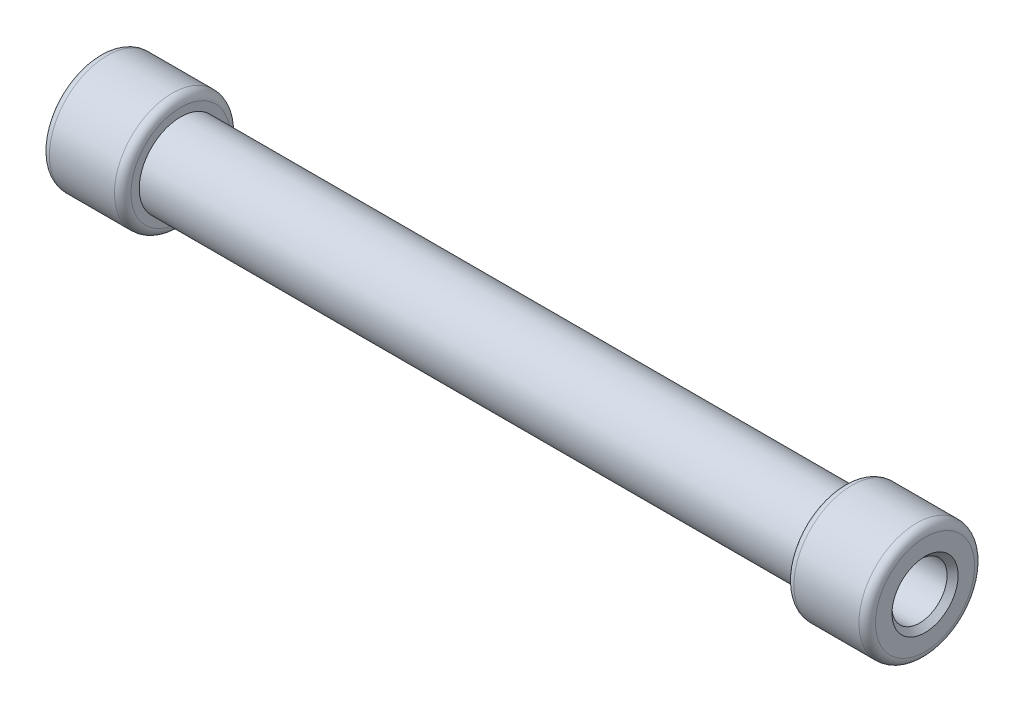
ISO-10303-21;
HEADER;
FILE_DESCRIPTION(('STEP AP214'),'2;1');
FILE_NAME('part.step','',(''),(''),'','','');
FILE_SCHEMA(('AUTOMOTIVE_DESIGN { 1 0 10303 214 1 1 1 1 }'));
ENDSEC;
DATA;
#1=APPLICATION_CONTEXT('core data for automotive mechanical design processes');
#2=APPLICATION_PROTOCOL_DEFINITION('international standard','automotive_design',2000,#1);
#3=PRODUCT_CONTEXT('',#1,'mechanical');
#4=PRODUCT('Part','Part','',(#3));
#5=PRODUCT_RELATED_PRODUCT_CATEGORY('part','',(#4));
#6=PRODUCT_DEFINITION_FORMATION('','',#4);
#7=PRODUCT_DEFINITION_CONTEXT('part definition',#1,'design');
#8=PRODUCT_DEFINITION('design','',#6,#7);
#9=PRODUCT_DEFINITION_SHAPE('','',#8);
#10=(LENGTH_UNIT() NAMED_UNIT(*) SI_UNIT(.MILLI.,.METRE.));
#11=(NAMED_UNIT(*) PLANE_ANGLE_UNIT() SI_UNIT($,.RADIAN.));
#12=(NAMED_UNIT(*) SI_UNIT($,.STERADIAN.) SOLID_ANGLE_UNIT());
#13=UNCERTAINTY_MEASURE_WITH_UNIT(LENGTH_MEASURE(1.E-05),#10,'distance_accuracy_value','');
#14=(GEOMETRIC_REPRESENTATION_CONTEXT(3) GLOBAL_UNCERTAINTY_ASSIGNED_CONTEXT((#13)) GLOBAL_UNIT_ASSIGNED_CONTEXT((#10,
#11,#12)) REPRESENTATION_CONTEXT('',''));
#15=CARTESIAN_POINT('',(0.,0.,0.));
#16=DIRECTION('',(0.,0.,1.));
#17=DIRECTION('',(1.,0.,0.));
#18=AXIS2_PLACEMENT_3D('',#15,#16,#17);
#19=CARTESIAN_POINT('',(32.1,0.,2.666666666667));
#20=DIRECTION('',(-1.,0.,0.));
#21=DIRECTION('',(0.,-1.,0.));
#22=AXIS2_PLACEMENT_3D('',#19,#20,#21);
#23=PLANE('',#22);
#24=CARTESIAN_POINT('',(32.1,0.,0.));
#25=DIRECTION('',(1.,0.,0.));
#26=DIRECTION('',(0.,1.,0.));
#27=AXIS2_PLACEMENT_3D('',#24,#25,#26);
#28=CIRCLE('',#27,2.666666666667);
#29=CARTESIAN_POINT('',(32.1,2.666666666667,0.));
#30=VERTEX_POINT('',#29);
#31=EDGE_CURVE('E65',#30,#30,#28,.T.);
#32=ORIENTED_EDGE('',*,*,#31,.T.);
#33=EDGE_LOOP('',(#32));
#34=FACE_BOUND('',#33,.T.);
#35=ADVANCED_FACE('F12',(#34),#23,.F.);
#36=CARTESIAN_POINT('',(40.,0.,0.));
#37=DIRECTION('',(1.,0.,0.));
#38=DIRECTION('',(0.,1.,0.));
#39=AXIS2_PLACEMENT_3D('',#36,#37,#38);
#40=CYLINDRICAL_SURFACE('',#39,2.666666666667);
#41=ORIENTED_EDGE('',*,*,#31,.F.);
#42=EDGE_LOOP('',(#41));
#43=FACE_BOUND('',#42,.T.);
#44=CARTESIAN_POINT('',(39.466666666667,0.,0.));
#45=DIRECTION('',(1.,0.,0.));
#46=DIRECTION('',(0.,1.,0.));
#47=AXIS2_PLACEMENT_3D('',#44,#45,#46);
#48=CIRCLE('',#47,2.666666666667);
#49=CARTESIAN_POINT('',(39.466666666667,2.666666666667,0.));
#50=VERTEX_POINT('',#49);
#51=EDGE_CURVE('E62',#50,#50,#48,.T.);
#52=ORIENTED_EDGE('',*,*,#51,.T.);
#53=EDGE_LOOP('',(#52));
#54=FACE_BOUND('',#53,.T.);
#55=ADVANCED_FACE('F70',(#43,#54),#40,.F.);
#56=CARTESIAN_POINT('',(40.,0.,0.));
#57=DIRECTION('',(1.,0.,0.));
#58=DIRECTION('',(0.,1.,0.));
#59=AXIS2_PLACEMENT_3D('',#56,#57,#58);
#60=CONICAL_SURFACE('',#59,3.2,0.785398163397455);
#61=ORIENTED_EDGE('',*,*,#51,.F.);
#62=EDGE_LOOP('',(#61));
#63=FACE_BOUND('',#62,.T.);
#64=CARTESIAN_POINT('',(40.,0.,0.));
#65=DIRECTION('',(1.,0.,0.));
#66=DIRECTION('',(0.,1.,0.));
#67=AXIS2_PLACEMENT_3D('',#64,#65,#66);
#68=CIRCLE('',#67,3.2);
#69=CARTESIAN_POINT('',(40.,3.2,0.));
#70=VERTEX_POINT('',#69);
#71=EDGE_CURVE('E59',#70,#70,#68,.T.);
#72=ORIENTED_EDGE('',*,*,#71,.T.);
#73=EDGE_LOOP('',(#72));
#74=FACE_BOUND('',#73,.T.);
#75=ADVANCED_FACE('F73',(#63,#74),#60,.F.);
#76=CARTESIAN_POINT('',(40.,0.,4.8));
#77=DIRECTION('',(-1.,0.,0.));
#78=DIRECTION('',(0.,-1.,0.));
#79=AXIS2_PLACEMENT_3D('',#76,#77,#78);
#80=PLANE('',#79);
#81=ORIENTED_EDGE('',*,*,#71,.F.);
#82=EDGE_LOOP('',(#81));
#83=FACE_BOUND('',#82,.T.);
#84=CARTESIAN_POINT('',(40.,0.,0.));
#85=DIRECTION('',(1.,0.,0.));
#86=DIRECTION('',(0.,1.,0.));
#87=AXIS2_PLACEMENT_3D('',#84,#85,#86);
#88=CIRCLE('',#87,4.79999999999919);
#89=CARTESIAN_POINT('',(40.,4.79999999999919,0.));
#90=VERTEX_POINT('',#89);
#91=EDGE_CURVE('E56',#90,#90,#88,.T.);
#92=ORIENTED_EDGE('',*,*,#91,.T.);
#93=EDGE_LOOP('',(#92));
#94=FACE_BOUND('',#93,.T.);
#95=ADVANCED_FACE('F79',(#83,#94),#80,.F.);
#96=CARTESIAN_POINT('',(39.1999999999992,0.,0.));
#97=DIRECTION('',(1.,0.,0.));
#98=DIRECTION('',(0.,1.,0.));
#99=AXIS2_PLACEMENT_3D('',#96,#97,#98);
#100=TOROIDAL_SURFACE('',#99,4.79999999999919,0.800000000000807);
#101=CARTESIAN_POINT('',(39.2,0.,0.));
#102=DIRECTION('',(1.,0.,0.));
#103=DIRECTION('',(0.,1.,0.));
#104=AXIS2_PLACEMENT_3D('',#101,#102,#103);
#105=CIRCLE('',#104,5.6);
#106=CARTESIAN_POINT('',(39.2,5.6,0.));
#107=VERTEX_POINT('',#106);
#108=EDGE_CURVE('E53',#107,#107,#105,.T.);
#109=ORIENTED_EDGE('',*,*,#108,.T.);
#110=EDGE_LOOP('',(#109));
#111=FACE_BOUND('',#110,.T.);
#112=ORIENTED_EDGE('',*,*,#91,.F.);
#113=EDGE_LOOP('',(#112));
#114=FACE_BOUND('',#113,.T.);
#115=ADVANCED_FACE('F85',(#111,#114),#100,.T.);
#116=CARTESIAN_POINT('',(40.,0.,0.));
#117=DIRECTION('',(1.,0.,0.));
#118=DIRECTION('',(0.,1.,0.));
#119=AXIS2_PLACEMENT_3D('',#116,#117,#118);
#120=CYLINDRICAL_SURFACE('',#119,5.6);
#121=ORIENTED_EDGE('',*,*,#108,.F.);
#122=EDGE_LOOP('',(#121));
#123=FACE_BOUND('',#122,.T.);
#124=CARTESIAN_POINT('',(32.9000000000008,0.,0.));
#125=DIRECTION('',(1.,0.,0.));
#126=DIRECTION('',(0.,1.,0.));
#127=AXIS2_PLACEMENT_3D('',#124,#125,#126);
#128=CIRCLE('',#127,5.6);
#129=CARTESIAN_POINT('',(32.9000000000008,5.6,0.));
#130=VERTEX_POINT('',#129);
#131=EDGE_CURVE('E50',#130,#130,#128,.T.);
#132=ORIENTED_EDGE('',*,*,#131,.T.);
#133=EDGE_LOOP('',(#132));
#134=FACE_BOUND('',#133,.T.);
#135=ADVANCED_FACE('F90',(#123,#134),#120,.T.);
#136=CARTESIAN_POINT('',(32.9000000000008,0.,0.));
#137=DIRECTION('',(1.,0.,0.));
#138=DIRECTION('',(0.,1.,0.));
#139=AXIS2_PLACEMENT_3D('',#136,#137,#138);
#140=TOROIDAL_SURFACE('',#139,4.79999999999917,0.800000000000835);
#141=CARTESIAN_POINT('',(32.1,0.,0.));
#142=DIRECTION('',(1.,0.,0.));
#143=DIRECTION('',(0.,1.,0.));
#144=AXIS2_PLACEMENT_3D('',#141,#142,#143);
#145=CIRCLE('',#144,4.8);
#146=CARTESIAN_POINT('',(32.1,4.8,0.));
#147=VERTEX_POINT('',#146);
#148=EDGE_CURVE('E47',#147,#147,#145,.T.);
#149=ORIENTED_EDGE('',*,*,#148,.T.);
#150=EDGE_LOOP('',(#149));
#151=FACE_BOUND('',#150,.T.);
#152=ORIENTED_EDGE('',*,*,#131,.F.);
#153=EDGE_LOOP('',(#152));
#154=FACE_BOUND('',#153,.T.);
#155=ADVANCED_FACE('F98',(#151,#154),#140,.T.);
#156=CARTESIAN_POINT('',(32.1,0.,4.));
#157=DIRECTION('',(1.,0.,0.));
#158=DIRECTION('',(0.,1.,0.));
#159=AXIS2_PLACEMENT_3D('',#156,#157,#158);
#160=PLANE('',#159);
#161=ORIENTED_EDGE('',*,*,#148,.F.);
#162=EDGE_LOOP('',(#161));
#163=FACE_BOUND('',#162,.T.);
#164=CARTESIAN_POINT('',(32.1,0.,0.));
#165=DIRECTION('',(1.,0.,0.));
#166=DIRECTION('',(0.,1.,0.));
#167=AXIS2_PLACEMENT_3D('',#164,#165,#166);
#168=CIRCLE('',#167,4.);
#169=CARTESIAN_POINT('',(32.1,4.,0.));
#170=VERTEX_POINT('',#169);
#171=EDGE_CURVE('E44',#170,#170,#168,.T.);
#172=ORIENTED_EDGE('',*,*,#171,.T.);
#173=EDGE_LOOP('',(#172));
#174=FACE_BOUND('',#173,.T.);
#175=ADVANCED_FACE('F145',(#163,#174),#160,.F.);
#176=CARTESIAN_POINT('',(-32.1,0.,0.));
#177=DIRECTION('',(1.,0.,0.));
#178=DIRECTION('',(0.,1.,0.));
#179=AXIS2_PLACEMENT_3D('',#176,#177,#178);
#180=PLANE('',#179);
#181=CARTESIAN_POINT('',(-32.1,0.,0.));
#182=DIRECTION('',(1.,0.,0.));
#183=DIRECTION('',(0.,1.,0.));
#184=AXIS2_PLACEMENT_3D('',#181,#182,#183);
#185=CIRCLE('',#184,2.666666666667);
#186=CARTESIAN_POINT('',(-32.1,2.666666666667,0.));
#187=VERTEX_POINT('',#186);
#188=EDGE_CURVE('E8',#187,#187,#185,.T.);
#189=ORIENTED_EDGE('',*,*,#188,.F.);
#190=EDGE_LOOP('',(#189));
#191=FACE_BOUND('',#190,.T.);
#192=ADVANCED_FACE('F14',(#191),#180,.F.);
#193=CARTESIAN_POINT('',(40.,0.,0.));
#194=DIRECTION('',(1.,0.,0.));
#195=DIRECTION('',(0.,1.,0.));
#196=AXIS2_PLACEMENT_3D('',#193,#194,#195);
#197=CYLINDRICAL_SURFACE('',#196,2.666666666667);
#198=CARTESIAN_POINT('',(-39.466666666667,0.,0.));
#199=DIRECTION('',(1.,0.,0.));
#200=DIRECTION('',(0.,1.,0.));
#201=AXIS2_PLACEMENT_3D('',#198,#199,#200);
#202=CIRCLE('',#201,2.666666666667);
#203=CARTESIAN_POINT('',(-39.466666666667,2.666666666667,0.));
#204=VERTEX_POINT('',#203);
#205=EDGE_CURVE('E19',#204,#204,#202,.T.);
#206=ORIENTED_EDGE('',*,*,#205,.F.);
#207=EDGE_LOOP('',(#206));
#208=FACE_BOUND('',#207,.T.);
#209=ORIENTED_EDGE('',*,*,#188,.T.);
#210=EDGE_LOOP('',(#209));
#211=FACE_BOUND('',#210,.T.);
#212=ADVANCED_FACE('F161',(#208,#211),#197,.F.);
#213=CARTESIAN_POINT('',(-39.466666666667,0.,0.));
#214=DIRECTION('',(-1.,0.,0.));
#215=DIRECTION('',(0.,-1.,0.));
#216=AXIS2_PLACEMENT_3D('',#213,#214,#215);
#217=CONICAL_SURFACE('',#216,2.666666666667,0.785398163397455);
#218=CARTESIAN_POINT('',(-40.,0.,0.));
#219=DIRECTION('',(1.,0.,0.));
#220=DIRECTION('',(0.,1.,0.));
#221=AXIS2_PLACEMENT_3D('',#218,#219,#220);
#222=CIRCLE('',#221,3.2);
#223=CARTESIAN_POINT('',(-40.,3.2,0.));
#224=VERTEX_POINT('',#223);
#225=EDGE_CURVE('E23',#224,#224,#222,.T.);
#226=ORIENTED_EDGE('',*,*,#225,.F.);
#227=EDGE_LOOP('',(#226));
#228=FACE_BOUND('',#227,.T.);
#229=ORIENTED_EDGE('',*,*,#205,.T.);
#230=EDGE_LOOP('',(#229));
#231=FACE_BOUND('',#230,.T.);
#232=ADVANCED_FACE('F169',(#228,#231),#217,.F.);
#233=CARTESIAN_POINT('',(-40.,0.,3.2));
#234=DIRECTION('',(1.,0.,0.));
#235=DIRECTION('',(0.,1.,0.));
#236=AXIS2_PLACEMENT_3D('',#233,#234,#235);
#237=PLANE('',#236);
#238=CARTESIAN_POINT('',(-40.,0.,0.));
#239=DIRECTION('',(1.,0.,0.));
#240=DIRECTION('',(0.,1.,0.));
#241=AXIS2_PLACEMENT_3D('',#238,#239,#240);
#242=CIRCLE('',#241,4.8);
#243=CARTESIAN_POINT('',(-40.,4.8,0.));
#244=VERTEX_POINT('',#243);
#245=EDGE_CURVE('E27',#244,#244,#242,.T.);
#246=ORIENTED_EDGE('',*,*,#245,.F.);
#247=EDGE_LOOP('',(#246));
#248=FACE_BOUND('',#247,.T.);
#249=ORIENTED_EDGE('',*,*,#225,.T.);
#250=EDGE_LOOP('',(#249));
#251=FACE_BOUND('',#250,.T.);
#252=ADVANCED_FACE('F177',(#248,#251),#237,.F.);
#253=CARTESIAN_POINT('',(-39.1999999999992,0.,0.));
#254=DIRECTION('',(1.,0.,0.));
#255=DIRECTION('',(0.,1.,0.));
#256=AXIS2_PLACEMENT_3D('',#253,#254,#255);
#257=TOROIDAL_SURFACE('',#256,4.79999999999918,0.800000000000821);
#258=ORIENTED_EDGE('',*,*,#245,.T.);
#259=EDGE_LOOP('',(#258));
#260=FACE_BOUND('',#259,.T.);
#261=CARTESIAN_POINT('',(-39.1999999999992,0.,0.));
#262=DIRECTION('',(1.,0.,0.));
#263=DIRECTION('',(0.,1.,0.));
#264=AXIS2_PLACEMENT_3D('',#261,#262,#263);
#265=CIRCLE('',#264,5.6);
#266=CARTESIAN_POINT('',(-39.1999999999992,5.6,0.));
#267=VERTEX_POINT('',#266);
#268=EDGE_CURVE('E32',#267,#267,#265,.T.);
#269=ORIENTED_EDGE('',*,*,#268,.F.);
#270=EDGE_LOOP('',(#269));
#271=FACE_BOUND('',#270,.T.);
#272=ADVANCED_FACE('F186',(#260,#271),#257,.T.);
#273=CARTESIAN_POINT('',(40.,0.,0.));
#274=DIRECTION('',(1.,0.,0.));
#275=DIRECTION('',(0.,1.,0.));
#276=AXIS2_PLACEMENT_3D('',#273,#274,#275);
#277=CYLINDRICAL_SURFACE('',#276,5.6);
#278=CARTESIAN_POINT('',(-32.9,0.,0.));
#279=DIRECTION('',(1.,0.,0.));
#280=DIRECTION('',(0.,1.,0.));
#281=AXIS2_PLACEMENT_3D('',#278,#279,#280);
#282=CIRCLE('',#281,5.6);
#283=CARTESIAN_POINT('',(-32.9,5.6,0.));
#284=VERTEX_POINT('',#283);
#285=EDGE_CURVE('E35',#284,#284,#282,.T.);
#286=ORIENTED_EDGE('',*,*,#285,.F.);
#287=EDGE_LOOP('',(#286));
#288=FACE_BOUND('',#287,.T.);
#289=ORIENTED_EDGE('',*,*,#268,.T.);
#290=EDGE_LOOP('',(#289));
#291=FACE_BOUND('',#290,.T.);
#292=ADVANCED_FACE('F195',(#288,#291),#277,.T.);
#293=CARTESIAN_POINT('',(-32.9000000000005,0.,0.));
#294=DIRECTION('',(1.,0.,0.));
#295=DIRECTION('',(0.,1.,0.));
#296=AXIS2_PLACEMENT_3D('',#293,#294,#295);
#297=TOROIDAL_SURFACE('',#296,4.79999999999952,0.800000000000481);
#298=ORIENTED_EDGE('',*,*,#285,.T.);
#299=EDGE_LOOP('',(#298));
#300=FACE_BOUND('',#299,.T.);
#301=CARTESIAN_POINT('',(-32.1,0.,0.));
#302=DIRECTION('',(1.,0.,0.));
#303=DIRECTION('',(0.,1.,0.));
#304=AXIS2_PLACEMENT_3D('',#301,#302,#303);
#305=CIRCLE('',#304,4.80000001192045);
#306=CARTESIAN_POINT('',(-32.1,4.80000001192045,0.));
#307=VERTEX_POINT('',#306);
#308=EDGE_CURVE('E38',#307,#307,#305,.T.);
#309=ORIENTED_EDGE('',*,*,#308,.F.);
#310=EDGE_LOOP('',(#309));
#311=FACE_BOUND('',#310,.T.);
#312=ADVANCED_FACE('F204',(#300,#311),#297,.T.);
#313=CARTESIAN_POINT('',(-32.1,0.,4.8));
#314=DIRECTION('',(-1.,0.,0.));
#315=DIRECTION('',(0.,-1.,0.));
#316=AXIS2_PLACEMENT_3D('',#313,#314,#315);
#317=PLANE('',#316);
#318=CARTESIAN_POINT('',(-32.1,0.,0.));
#319=DIRECTION('',(1.,0.,0.));
#320=DIRECTION('',(0.,1.,0.));
#321=AXIS2_PLACEMENT_3D('',#318,#319,#320);
#322=CIRCLE('',#321,4.);
#323=CARTESIAN_POINT('',(-32.1,4.,0.));
#324=VERTEX_POINT('',#323);
#325=EDGE_CURVE('E41',#324,#324,#322,.T.);
#326=ORIENTED_EDGE('',*,*,#325,.F.);
#327=EDGE_LOOP('',(#326));
#328=FACE_BOUND('',#327,.T.);
#329=ORIENTED_EDGE('',*,*,#308,.T.);
#330=EDGE_LOOP('',(#329));
#331=FACE_BOUND('',#330,.T.);
#332=ADVANCED_FACE('F213',(#328,#331),#317,.F.);
#333=CARTESIAN_POINT('',(40.,0.,0.));
#334=DIRECTION('',(1.,0.,0.));
#335=DIRECTION('',(0.,1.,0.));
#336=AXIS2_PLACEMENT_3D('',#333,#334,#335);
#337=CYLINDRICAL_SURFACE('',#336,4.);
#338=ORIENTED_EDGE('',*,*,#325,.T.);
#339=EDGE_LOOP('',(#338));
#340=FACE_BOUND('',#339,.T.);
#341=ORIENTED_EDGE('',*,*,#171,.F.);
#342=EDGE_LOOP('',(#341));
#343=FACE_BOUND('',#342,.T.);
#344=ADVANCED_FACE('F222',(#340,#343),#337,.T.);
#345=CLOSED_SHELL('',(#35,#55,#75,#95,#115,#135,#155,#175,#192,#212,#232,#252,#272,#292,#312,
#332,#344));
#346=MANIFOLD_SOLID_BREP('B1',#345);
#347=ADVANCED_BREP_SHAPE_REPRESENTATION('',(#18,#346),#14);
#348=SHAPE_DEFINITION_REPRESENTATION(#9,#347);
ENDSEC;
END-ISO-10303-21;
